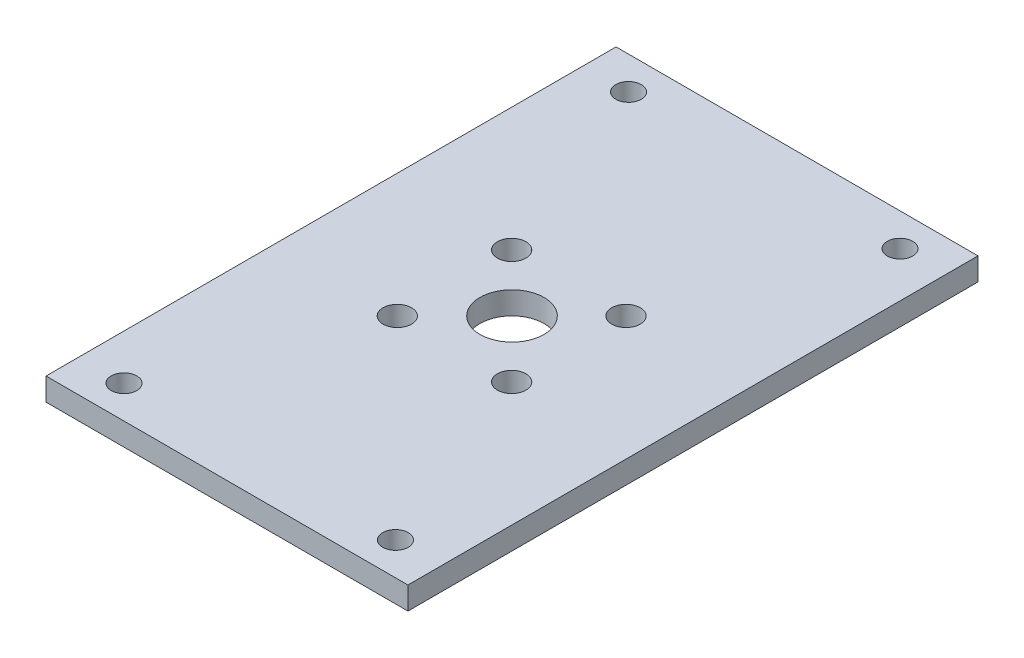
ISO-10303-21;
HEADER;
FILE_DESCRIPTION(('STEP AP214'),'2;1');
FILE_NAME('part.step','',(''),(''),'','','');
FILE_SCHEMA(('AUTOMOTIVE_DESIGN { 1 0 10303 214 1 1 1 1 }'));
ENDSEC;
DATA;
#1=APPLICATION_CONTEXT('core data for automotive mechanical design processes');
#2=APPLICATION_PROTOCOL_DEFINITION('international standard','automotive_design',2000,#1);
#3=PRODUCT_CONTEXT('',#1,'mechanical');
#4=PRODUCT('Part','Part','',(#3));
#5=PRODUCT_RELATED_PRODUCT_CATEGORY('part','',(#4));
#6=PRODUCT_DEFINITION_FORMATION('','',#4);
#7=PRODUCT_DEFINITION_CONTEXT('part definition',#1,'design');
#8=PRODUCT_DEFINITION('design','',#6,#7);
#9=PRODUCT_DEFINITION_SHAPE('','',#8);
#10=(LENGTH_UNIT() NAMED_UNIT(*) SI_UNIT(.MILLI.,.METRE.));
#11=(NAMED_UNIT(*) PLANE_ANGLE_UNIT() SI_UNIT($,.RADIAN.));
#12=(NAMED_UNIT(*) SI_UNIT($,.STERADIAN.) SOLID_ANGLE_UNIT());
#13=UNCERTAINTY_MEASURE_WITH_UNIT(LENGTH_MEASURE(1.E-05),#10,'distance_accuracy_value','');
#14=(GEOMETRIC_REPRESENTATION_CONTEXT(3) GLOBAL_UNCERTAINTY_ASSIGNED_CONTEXT((#13)) GLOBAL_UNIT_ASSIGNED_CONTEXT((#10,
#11,#12)) REPRESENTATION_CONTEXT('',''));
#15=CARTESIAN_POINT('',(0.,0.,0.));
#16=DIRECTION('',(0.,0.,1.));
#17=DIRECTION('',(1.,0.,0.));
#18=AXIS2_PLACEMENT_3D('',#15,#16,#17);
#19=CARTESIAN_POINT('',(-25.4,3.175,-40.005));
#20=DIRECTION('',(0.,0.,1.));
#21=DIRECTION('',(1.,0.,0.));
#22=AXIS2_PLACEMENT_3D('',#19,#20,#21);
#23=PLANE('',#22);
#24=DIRECTION('',(-1.,0.,0.));
#25=VECTOR('',#24,1.);
#26=CARTESIAN_POINT('',(-25.4,0.,-40.005));
#27=LINE('',#26,#25);
#28=CARTESIAN_POINT('',(25.4,0.,-40.005));
#29=VERTEX_POINT('',#28);
#30=CARTESIAN_POINT('',(-25.4,0.,-40.005));
#31=VERTEX_POINT('',#30);
#32=EDGE_CURVE('E102',#29,#31,#27,.T.);
#33=ORIENTED_EDGE('',*,*,#32,.T.);
#34=DIRECTION('',(0.,-1.,0.));
#35=VECTOR('',#34,1.);
#36=CARTESIAN_POINT('',(-25.4,3.175,-40.005));
#37=LINE('',#36,#35);
#38=CARTESIAN_POINT('',(-25.4,3.175,-40.005));
#39=VERTEX_POINT('',#38);
#40=EDGE_CURVE('E11',#39,#31,#37,.T.);
#41=ORIENTED_EDGE('',*,*,#40,.F.);
#42=DIRECTION('',(-1.,0.,0.));
#43=VECTOR('',#42,1.);
#44=CARTESIAN_POINT('',(-25.4,3.175,-40.005));
#45=LINE('',#44,#43);
#46=CARTESIAN_POINT('',(25.4,3.175,-40.005));
#47=VERTEX_POINT('',#46);
#48=EDGE_CURVE('E90',#47,#39,#45,.T.);
#49=ORIENTED_EDGE('',*,*,#48,.F.);
#50=DIRECTION('',(0.,-1.,0.));
#51=VECTOR('',#50,1.);
#52=CARTESIAN_POINT('',(25.4,3.175,-40.005));
#53=LINE('',#52,#51);
#54=EDGE_CURVE('E98',#47,#29,#53,.T.);
#55=ORIENTED_EDGE('',*,*,#54,.T.);
#56=EDGE_LOOP('',(#33,#41,#49,#55));
#57=FACE_BOUND('',#56,.T.);
#58=ADVANCED_FACE('F39',(#57),#23,.F.);
#59=CARTESIAN_POINT('',(-25.4,3.175,-40.005));
#60=DIRECTION('',(1.,0.,0.));
#61=DIRECTION('',(0.,0.,-1.));
#62=AXIS2_PLACEMENT_3D('',#59,#60,#61);
#63=PLANE('',#62);
#64=DIRECTION('',(0.,0.,1.));
#65=VECTOR('',#64,1.);
#66=CARTESIAN_POINT('',(-25.4,0.,-40.005));
#67=LINE('',#66,#65);
#68=CARTESIAN_POINT('',(-25.4,0.,40.005));
#69=VERTEX_POINT('',#68);
#70=EDGE_CURVE('E94',#31,#69,#67,.T.);
#71=ORIENTED_EDGE('',*,*,#70,.T.);
#72=DIRECTION('',(0.,-1.,0.));
#73=VECTOR('',#72,1.);
#74=CARTESIAN_POINT('',(-25.4,3.175,40.005));
#75=LINE('',#74,#73);
#76=CARTESIAN_POINT('',(-25.4,3.175,40.005));
#77=VERTEX_POINT('',#76);
#78=EDGE_CURVE('E47',#77,#69,#75,.T.);
#79=ORIENTED_EDGE('',*,*,#78,.F.);
#80=DIRECTION('',(0.,0.,1.));
#81=VECTOR('',#80,1.);
#82=CARTESIAN_POINT('',(-25.4,3.175,-40.005));
#83=LINE('',#82,#81);
#84=EDGE_CURVE('E85',#39,#77,#83,.T.);
#85=ORIENTED_EDGE('',*,*,#84,.F.);
#86=ORIENTED_EDGE('',*,*,#40,.T.);
#87=EDGE_LOOP('',(#71,#79,#85,#86));
#88=FACE_BOUND('',#87,.T.);
#89=ADVANCED_FACE('F93',(#88),#63,.F.);
#90=CARTESIAN_POINT('',(25.4,3.175,40.005));
#91=DIRECTION('',(0.,0.,-1.));
#92=DIRECTION('',(-1.,0.,0.));
#93=AXIS2_PLACEMENT_3D('',#90,#91,#92);
#94=PLANE('',#93);
#95=DIRECTION('',(1.,0.,0.));
#96=VECTOR('',#95,1.);
#97=CARTESIAN_POINT('',(25.4,0.,40.005));
#98=LINE('',#97,#96);
#99=CARTESIAN_POINT('',(25.4,0.,40.005));
#100=VERTEX_POINT('',#99);
#101=EDGE_CURVE('E72',#69,#100,#98,.T.);
#102=ORIENTED_EDGE('',*,*,#101,.T.);
#103=DIRECTION('',(0.,-1.,0.));
#104=VECTOR('',#103,1.);
#105=CARTESIAN_POINT('',(25.4,3.175,40.005));
#106=LINE('',#105,#104);
#107=CARTESIAN_POINT('',(25.4,3.175,40.005));
#108=VERTEX_POINT('',#107);
#109=EDGE_CURVE('E95',#108,#100,#106,.T.);
#110=ORIENTED_EDGE('',*,*,#109,.F.);
#111=DIRECTION('',(1.,0.,0.));
#112=VECTOR('',#111,1.);
#113=CARTESIAN_POINT('',(25.4,3.175,40.005));
#114=LINE('',#113,#112);
#115=EDGE_CURVE('E88',#77,#108,#114,.T.);
#116=ORIENTED_EDGE('',*,*,#115,.F.);
#117=ORIENTED_EDGE('',*,*,#78,.T.);
#118=EDGE_LOOP('',(#102,#110,#116,#117));
#119=FACE_BOUND('',#118,.T.);
#120=ADVANCED_FACE('F96',(#119),#94,.F.);
#121=CARTESIAN_POINT('',(25.4,3.175,-40.005));
#122=DIRECTION('',(-1.,0.,0.));
#123=DIRECTION('',(0.,0.,1.));
#124=AXIS2_PLACEMENT_3D('',#121,#122,#123);
#125=PLANE('',#124);
#126=DIRECTION('',(0.,0.,-1.));
#127=VECTOR('',#126,1.);
#128=CARTESIAN_POINT('',(25.4,0.,-40.005));
#129=LINE('',#128,#127);
#130=EDGE_CURVE('E78',#100,#29,#129,.T.);
#131=ORIENTED_EDGE('',*,*,#130,.T.);
#132=ORIENTED_EDGE('',*,*,#54,.F.);
#133=DIRECTION('',(0.,0.,-1.));
#134=VECTOR('',#133,1.);
#135=CARTESIAN_POINT('',(25.4,3.175,-40.005));
#136=LINE('',#135,#134);
#137=EDGE_CURVE('E55',#108,#47,#136,.T.);
#138=ORIENTED_EDGE('',*,*,#137,.F.);
#139=ORIENTED_EDGE('',*,*,#109,.T.);
#140=EDGE_LOOP('',(#131,#132,#138,#139));
#141=FACE_BOUND('',#140,.T.);
#142=ADVANCED_FACE('F110',(#141),#125,.F.);
#143=CARTESIAN_POINT('',(0.,3.175,0.));
#144=DIRECTION('',(0.,-1.,0.));
#145=DIRECTION('',(0.,0.,-1.));
#146=AXIS2_PLACEMENT_3D('',#143,#144,#145);
#147=PLANE('',#146);
#148=CARTESIAN_POINT('',(-19.05,3.175,35.4076));
#149=DIRECTION('',(0.,-1.,0.));
#150=DIRECTION('',(0.,0.,-1.));
#151=AXIS2_PLACEMENT_3D('',#148,#149,#150);
#152=CIRCLE('',#151,1.7907);
#153=CARTESIAN_POINT('',(-19.05,3.175,33.6169));
#154=VERTEX_POINT('',#153);
#155=EDGE_CURVE('E158',#154,#154,#152,.T.);
#156=ORIENTED_EDGE('',*,*,#155,.T.);
#157=EDGE_LOOP('',(#156));
#158=FACE_BOUND('',#157,.T.);
#159=CARTESIAN_POINT('',(19.05,3.175,35.4076));
#160=DIRECTION('',(0.,-1.,0.));
#161=DIRECTION('',(0.,0.,-1.));
#162=AXIS2_PLACEMENT_3D('',#159,#160,#161);
#163=CIRCLE('',#162,1.7907);
#164=CARTESIAN_POINT('',(19.05,3.175,33.6169));
#165=VERTEX_POINT('',#164);
#166=EDGE_CURVE('E157',#165,#165,#163,.T.);
#167=ORIENTED_EDGE('',*,*,#166,.T.);
#168=EDGE_LOOP('',(#167));
#169=FACE_BOUND('',#168,.T.);
#170=CARTESIAN_POINT('',(0.,3.175,0.));
#171=DIRECTION('',(0.,-1.,0.));
#172=DIRECTION('',(0.,0.,-1.));
#173=AXIS2_PLACEMENT_3D('',#170,#171,#172);
#174=CIRCLE('',#173,4.5);
#175=CARTESIAN_POINT('',(0.,3.175,-4.5));
#176=VERTEX_POINT('',#175);
#177=EDGE_CURVE('E147',#176,#176,#174,.T.);
#178=ORIENTED_EDGE('',*,*,#177,.T.);
#179=EDGE_LOOP('',(#178));
#180=FACE_BOUND('',#179,.T.);
#181=CARTESIAN_POINT('',(-19.05,3.175,-35.4076));
#182=DIRECTION('',(0.,-1.,0.));
#183=DIRECTION('',(0.,0.,-1.));
#184=AXIS2_PLACEMENT_3D('',#181,#182,#183);
#185=CIRCLE('',#184,1.7907);
#186=CARTESIAN_POINT('',(-19.05,3.175,-37.1983));
#187=VERTEX_POINT('',#186);
#188=EDGE_CURVE('E126',#187,#187,#185,.T.);
#189=ORIENTED_EDGE('',*,*,#188,.T.);
#190=EDGE_LOOP('',(#189));
#191=FACE_BOUND('',#190,.T.);
#192=CARTESIAN_POINT('',(19.05,3.175,-35.4076));
#193=DIRECTION('',(0.,-1.,0.));
#194=DIRECTION('',(0.,0.,-1.));
#195=AXIS2_PLACEMENT_3D('',#192,#193,#194);
#196=CIRCLE('',#195,1.7907);
#197=CARTESIAN_POINT('',(19.05,3.175,-37.1983));
#198=VERTEX_POINT('',#197);
#199=EDGE_CURVE('E140',#198,#198,#196,.T.);
#200=ORIENTED_EDGE('',*,*,#199,.T.);
#201=EDGE_LOOP('',(#200));
#202=FACE_BOUND('',#201,.T.);
#203=CARTESIAN_POINT('',(-8.04962141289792,3.175,-8.00000027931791));
#204=DIRECTION('',(0.,1.,0.));
#205=DIRECTION('',(1.,0.,0.));
#206=AXIS2_PLACEMENT_3D('',#203,#204,#205);
#207=CIRCLE('',#206,2.);
#208=CARTESIAN_POINT('',(-6.04962141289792,3.175,-8.00000027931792));
#209=VERTEX_POINT('',#208);
#210=EDGE_CURVE('E119',#209,#209,#207,.T.);
#211=ORIENTED_EDGE('',*,*,#210,.F.);
#212=EDGE_LOOP('',(#211));
#213=FACE_BOUND('',#212,.T.);
#214=CARTESIAN_POINT('',(-8.04962141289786,3.175,8.04962141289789));
#215=DIRECTION('',(0.,1.,0.));
#216=DIRECTION('',(0.,0.,-1.));
#217=AXIS2_PLACEMENT_3D('',#214,#215,#216);
#218=CIRCLE('',#217,2.);
#219=CARTESIAN_POINT('',(-8.04962141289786,3.175,6.04962141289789));
#220=VERTEX_POINT('',#219);
#221=EDGE_CURVE('E132',#220,#220,#218,.T.);
#222=ORIENTED_EDGE('',*,*,#221,.F.);
#223=EDGE_LOOP('',(#222));
#224=FACE_BOUND('',#223,.T.);
#225=CARTESIAN_POINT('',(8.00000027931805,3.175,8.04962141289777));
#226=DIRECTION('',(0.,1.,0.));
#227=DIRECTION('',(-1.,0.,0.));
#228=AXIS2_PLACEMENT_3D('',#225,#226,#227);
#229=CIRCLE('',#228,2.);
#230=CARTESIAN_POINT('',(6.00000027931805,3.175,8.04962141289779));
#231=VERTEX_POINT('',#230);
#232=EDGE_CURVE('E125',#231,#231,#229,.T.);
#233=ORIENTED_EDGE('',*,*,#232,.F.);
#234=EDGE_LOOP('',(#233));
#235=FACE_BOUND('',#234,.T.);
#236=CARTESIAN_POINT('',(8.00000027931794,3.175,-8.00000027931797));
#237=DIRECTION('',(0.,1.,0.));
#238=DIRECTION('',(0.,0.,1.));
#239=AXIS2_PLACEMENT_3D('',#236,#237,#238);
#240=CIRCLE('',#239,2.);
#241=CARTESIAN_POINT('',(8.00000027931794,3.175,-6.00000027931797));
#242=VERTEX_POINT('',#241);
#243=EDGE_CURVE('E105',#242,#242,#240,.T.);
#244=ORIENTED_EDGE('',*,*,#243,.F.);
#245=EDGE_LOOP('',(#244));
#246=FACE_BOUND('',#245,.T.);
#247=ORIENTED_EDGE('',*,*,#48,.T.);
#248=ORIENTED_EDGE('',*,*,#84,.T.);
#249=ORIENTED_EDGE('',*,*,#115,.T.);
#250=ORIENTED_EDGE('',*,*,#137,.T.);
#251=EDGE_LOOP('',(#247,#248,#249,#250));
#252=FACE_BOUND('',#251,.T.);
#253=ADVANCED_FACE('F86',(#158,#169,#180,#191,#202,#213,#224,#235,#246,#252),#147,.F.);
#254=CARTESIAN_POINT('',(0.,0.,0.));
#255=DIRECTION('',(0.,-1.,0.));
#256=DIRECTION('',(0.,0.,-1.));
#257=AXIS2_PLACEMENT_3D('',#254,#255,#256);
#258=PLANE('',#257);
#259=CARTESIAN_POINT('',(-19.05,0.,35.4076));
#260=DIRECTION('',(0.,1.,0.));
#261=DIRECTION('',(0.,0.,-1.));
#262=AXIS2_PLACEMENT_3D('',#259,#260,#261);
#263=CIRCLE('',#262,1.7907);
#264=CARTESIAN_POINT('',(-19.05,0.,33.6169));
#265=VERTEX_POINT('',#264);
#266=EDGE_CURVE('E162',#265,#265,#263,.T.);
#267=ORIENTED_EDGE('',*,*,#266,.T.);
#268=EDGE_LOOP('',(#267));
#269=FACE_BOUND('',#268,.T.);
#270=CARTESIAN_POINT('',(19.05,0.,35.4076));
#271=DIRECTION('',(0.,1.,0.));
#272=DIRECTION('',(0.,0.,-1.));
#273=AXIS2_PLACEMENT_3D('',#270,#271,#272);
#274=CIRCLE('',#273,1.7907);
#275=CARTESIAN_POINT('',(19.05,0.,33.6169));
#276=VERTEX_POINT('',#275);
#277=EDGE_CURVE('E161',#276,#276,#274,.T.);
#278=ORIENTED_EDGE('',*,*,#277,.T.);
#279=EDGE_LOOP('',(#278));
#280=FACE_BOUND('',#279,.T.);
#281=CARTESIAN_POINT('',(0.,0.,0.));
#282=DIRECTION('',(0.,1.,0.));
#283=DIRECTION('',(0.,0.,1.));
#284=AXIS2_PLACEMENT_3D('',#281,#282,#283);
#285=CIRCLE('',#284,4.5);
#286=CARTESIAN_POINT('',(0.,0.,4.5));
#287=VERTEX_POINT('',#286);
#288=EDGE_CURVE('E154',#287,#287,#285,.T.);
#289=ORIENTED_EDGE('',*,*,#288,.T.);
#290=EDGE_LOOP('',(#289));
#291=FACE_BOUND('',#290,.T.);
#292=CARTESIAN_POINT('',(-19.05,0.,-35.4076));
#293=DIRECTION('',(0.,1.,0.));
#294=DIRECTION('',(0.,0.,1.));
#295=AXIS2_PLACEMENT_3D('',#292,#293,#294);
#296=CIRCLE('',#295,1.7907);
#297=CARTESIAN_POINT('',(-19.05,0.,-33.6169));
#298=VERTEX_POINT('',#297);
#299=EDGE_CURVE('E143',#298,#298,#296,.T.);
#300=ORIENTED_EDGE('',*,*,#299,.T.);
#301=EDGE_LOOP('',(#300));
#302=FACE_BOUND('',#301,.T.);
#303=CARTESIAN_POINT('',(19.05,0.,-35.4076));
#304=DIRECTION('',(0.,1.,0.));
#305=DIRECTION('',(0.,0.,1.));
#306=AXIS2_PLACEMENT_3D('',#303,#304,#305);
#307=CIRCLE('',#306,1.7907);
#308=CARTESIAN_POINT('',(19.05,0.,-33.6169));
#309=VERTEX_POINT('',#308);
#310=EDGE_CURVE('E144',#309,#309,#307,.T.);
#311=ORIENTED_EDGE('',*,*,#310,.T.);
#312=EDGE_LOOP('',(#311));
#313=FACE_BOUND('',#312,.T.);
#314=CARTESIAN_POINT('',(-8.04962141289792,0.,-8.00000027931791));
#315=DIRECTION('',(0.,1.,0.));
#316=DIRECTION('',(1.,0.,0.));
#317=AXIS2_PLACEMENT_3D('',#314,#315,#316);
#318=CIRCLE('',#317,2.);
#319=CARTESIAN_POINT('',(-6.04962141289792,0.,-8.00000027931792));
#320=VERTEX_POINT('',#319);
#321=EDGE_CURVE('E135',#320,#320,#318,.T.);
#322=ORIENTED_EDGE('',*,*,#321,.T.);
#323=EDGE_LOOP('',(#322));
#324=FACE_BOUND('',#323,.T.);
#325=CARTESIAN_POINT('',(-8.04962141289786,0.,8.04962141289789));
#326=DIRECTION('',(0.,1.,0.));
#327=DIRECTION('',(0.,0.,-1.));
#328=AXIS2_PLACEMENT_3D('',#325,#326,#327);
#329=CIRCLE('',#328,2.);
#330=CARTESIAN_POINT('',(-8.04962141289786,0.,6.04962141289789));
#331=VERTEX_POINT('',#330);
#332=EDGE_CURVE('E129',#331,#331,#329,.T.);
#333=ORIENTED_EDGE('',*,*,#332,.T.);
#334=EDGE_LOOP('',(#333));
#335=FACE_BOUND('',#334,.T.);
#336=CARTESIAN_POINT('',(8.00000027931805,0.,8.04962141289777));
#337=DIRECTION('',(0.,1.,0.));
#338=DIRECTION('',(-1.,0.,0.));
#339=AXIS2_PLACEMENT_3D('',#336,#337,#338);
#340=CIRCLE('',#339,2.);
#341=CARTESIAN_POINT('',(6.00000027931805,0.,8.04962141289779));
#342=VERTEX_POINT('',#341);
#343=EDGE_CURVE('E122',#342,#342,#340,.T.);
#344=ORIENTED_EDGE('',*,*,#343,.T.);
#345=EDGE_LOOP('',(#344));
#346=FACE_BOUND('',#345,.T.);
#347=CARTESIAN_POINT('',(8.00000027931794,0.,-8.00000027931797));
#348=DIRECTION('',(0.,1.,0.));
#349=DIRECTION('',(0.,0.,1.));
#350=AXIS2_PLACEMENT_3D('',#347,#348,#349);
#351=CIRCLE('',#350,2.);
#352=CARTESIAN_POINT('',(8.00000027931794,0.,-6.00000027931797));
#353=VERTEX_POINT('',#352);
#354=EDGE_CURVE('E116',#353,#353,#351,.T.);
#355=ORIENTED_EDGE('',*,*,#354,.T.);
#356=EDGE_LOOP('',(#355));
#357=FACE_BOUND('',#356,.T.);
#358=ORIENTED_EDGE('',*,*,#32,.F.);
#359=ORIENTED_EDGE('',*,*,#130,.F.);
#360=ORIENTED_EDGE('',*,*,#101,.F.);
#361=ORIENTED_EDGE('',*,*,#70,.F.);
#362=EDGE_LOOP('',(#358,#359,#360,#361));
#363=FACE_BOUND('',#362,.T.);
#364=ADVANCED_FACE('F113',(#269,#280,#291,#302,#313,#324,#335,#346,#357,#363),#258,.T.);
#365=CARTESIAN_POINT('',(8.00000027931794,3.175,-8.00000027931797));
#366=DIRECTION('',(0.,-1.,0.));
#367=DIRECTION('',(0.,0.,-1.));
#368=AXIS2_PLACEMENT_3D('',#365,#366,#367);
#369=CYLINDRICAL_SURFACE('',#368,2.);
#370=ORIENTED_EDGE('',*,*,#243,.T.);
#371=EDGE_LOOP('',(#370));
#372=FACE_BOUND('',#371,.T.);
#373=ORIENTED_EDGE('',*,*,#354,.F.);
#374=EDGE_LOOP('',(#373));
#375=FACE_BOUND('',#374,.T.);
#376=ADVANCED_FACE('F201',(#372,#375),#369,.F.);
#377=CARTESIAN_POINT('',(8.00000027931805,3.175,8.04962141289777));
#378=DIRECTION('',(0.,-1.,0.));
#379=DIRECTION('',(0.,0.,-1.));
#380=AXIS2_PLACEMENT_3D('',#377,#378,#379);
#381=CYLINDRICAL_SURFACE('',#380,2.);
#382=ORIENTED_EDGE('',*,*,#232,.T.);
#383=EDGE_LOOP('',(#382));
#384=FACE_BOUND('',#383,.T.);
#385=ORIENTED_EDGE('',*,*,#343,.F.);
#386=EDGE_LOOP('',(#385));
#387=FACE_BOUND('',#386,.T.);
#388=ADVANCED_FACE('F208',(#384,#387),#381,.F.);
#389=CARTESIAN_POINT('',(-8.04962141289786,3.175,8.04962141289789));
#390=DIRECTION('',(0.,-1.,0.));
#391=DIRECTION('',(0.,0.,-1.));
#392=AXIS2_PLACEMENT_3D('',#389,#390,#391);
#393=CYLINDRICAL_SURFACE('',#392,2.);
#394=ORIENTED_EDGE('',*,*,#221,.T.);
#395=EDGE_LOOP('',(#394));
#396=FACE_BOUND('',#395,.T.);
#397=ORIENTED_EDGE('',*,*,#332,.F.);
#398=EDGE_LOOP('',(#397));
#399=FACE_BOUND('',#398,.T.);
#400=ADVANCED_FACE('F212',(#396,#399),#393,.F.);
#401=CARTESIAN_POINT('',(-8.04962141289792,3.175,-8.00000027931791));
#402=DIRECTION('',(0.,-1.,0.));
#403=DIRECTION('',(0.,0.,-1.));
#404=AXIS2_PLACEMENT_3D('',#401,#402,#403);
#405=CYLINDRICAL_SURFACE('',#404,2.);
#406=ORIENTED_EDGE('',*,*,#210,.T.);
#407=EDGE_LOOP('',(#406));
#408=FACE_BOUND('',#407,.T.);
#409=ORIENTED_EDGE('',*,*,#321,.F.);
#410=EDGE_LOOP('',(#409));
#411=FACE_BOUND('',#410,.T.);
#412=ADVANCED_FACE('F216',(#408,#411),#405,.F.);
#413=CARTESIAN_POINT('',(19.05,8.23986445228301,-35.4076));
#414=DIRECTION('',(0.,-1.,0.));
#415=DIRECTION('',(0.,0.,-1.));
#416=AXIS2_PLACEMENT_3D('',#413,#414,#415);
#417=CYLINDRICAL_SURFACE('',#416,1.7907);
#418=ORIENTED_EDGE('',*,*,#199,.F.);
#419=EDGE_LOOP('',(#418));
#420=FACE_BOUND('',#419,.T.);
#421=ORIENTED_EDGE('',*,*,#310,.F.);
#422=EDGE_LOOP('',(#421));
#423=FACE_BOUND('',#422,.T.);
#424=ADVANCED_FACE('F220',(#420,#423),#417,.F.);
#425=CARTESIAN_POINT('',(-19.05,8.23986445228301,-35.4076));
#426=DIRECTION('',(0.,-1.,0.));
#427=DIRECTION('',(0.,0.,-1.));
#428=AXIS2_PLACEMENT_3D('',#425,#426,#427);
#429=CYLINDRICAL_SURFACE('',#428,1.7907);
#430=ORIENTED_EDGE('',*,*,#188,.F.);
#431=EDGE_LOOP('',(#430));
#432=FACE_BOUND('',#431,.T.);
#433=ORIENTED_EDGE('',*,*,#299,.F.);
#434=EDGE_LOOP('',(#433));
#435=FACE_BOUND('',#434,.T.);
#436=ADVANCED_FACE('F184',(#432,#435),#429,.F.);
#437=CARTESIAN_POINT('',(0.,15.9029220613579,0.));
#438=DIRECTION('',(0.,-1.,0.));
#439=DIRECTION('',(0.,0.,-1.));
#440=AXIS2_PLACEMENT_3D('',#437,#438,#439);
#441=CYLINDRICAL_SURFACE('',#440,4.5);
#442=ORIENTED_EDGE('',*,*,#177,.F.);
#443=EDGE_LOOP('',(#442));
#444=FACE_BOUND('',#443,.T.);
#445=ORIENTED_EDGE('',*,*,#288,.F.);
#446=EDGE_LOOP('',(#445));
#447=FACE_BOUND('',#446,.T.);
#448=ADVANCED_FACE('F175',(#444,#447),#441,.F.);
#449=CARTESIAN_POINT('',(19.05,8.23986445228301,35.4076));
#450=DIRECTION('',(0.,-1.,0.));
#451=DIRECTION('',(0.,0.,-1.));
#452=AXIS2_PLACEMENT_3D('',#449,#450,#451);
#453=CYLINDRICAL_SURFACE('',#452,1.7907);
#454=ORIENTED_EDGE('',*,*,#166,.F.);
#455=EDGE_LOOP('',(#454));
#456=FACE_BOUND('',#455,.T.);
#457=ORIENTED_EDGE('',*,*,#277,.F.);
#458=EDGE_LOOP('',(#457));
#459=FACE_BOUND('',#458,.T.);
#460=ADVANCED_FACE('F172',(#456,#459),#453,.F.);
#461=CARTESIAN_POINT('',(-19.05,8.23986445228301,35.4076));
#462=DIRECTION('',(0.,-1.,0.));
#463=DIRECTION('',(0.,0.,-1.));
#464=AXIS2_PLACEMENT_3D('',#461,#462,#463);
#465=CYLINDRICAL_SURFACE('',#464,1.7907);
#466=ORIENTED_EDGE('',*,*,#155,.F.);
#467=EDGE_LOOP('',(#466));
#468=FACE_BOUND('',#467,.T.);
#469=ORIENTED_EDGE('',*,*,#266,.F.);
#470=EDGE_LOOP('',(#469));
#471=FACE_BOUND('',#470,.T.);
#472=ADVANCED_FACE('F174',(#468,#471),#465,.F.);
#473=CLOSED_SHELL('',(#58,#89,#120,#142,#253,#364,#376,#388,#400,#412,#424,#436,#448,#460,#472));
#474=MANIFOLD_SOLID_BREP('B2',#473);
#475=ADVANCED_BREP_SHAPE_REPRESENTATION('',(#18,#474),#14);
#476=SHAPE_DEFINITION_REPRESENTATION(#9,#475);
ENDSEC;
END-ISO-10303-21;
